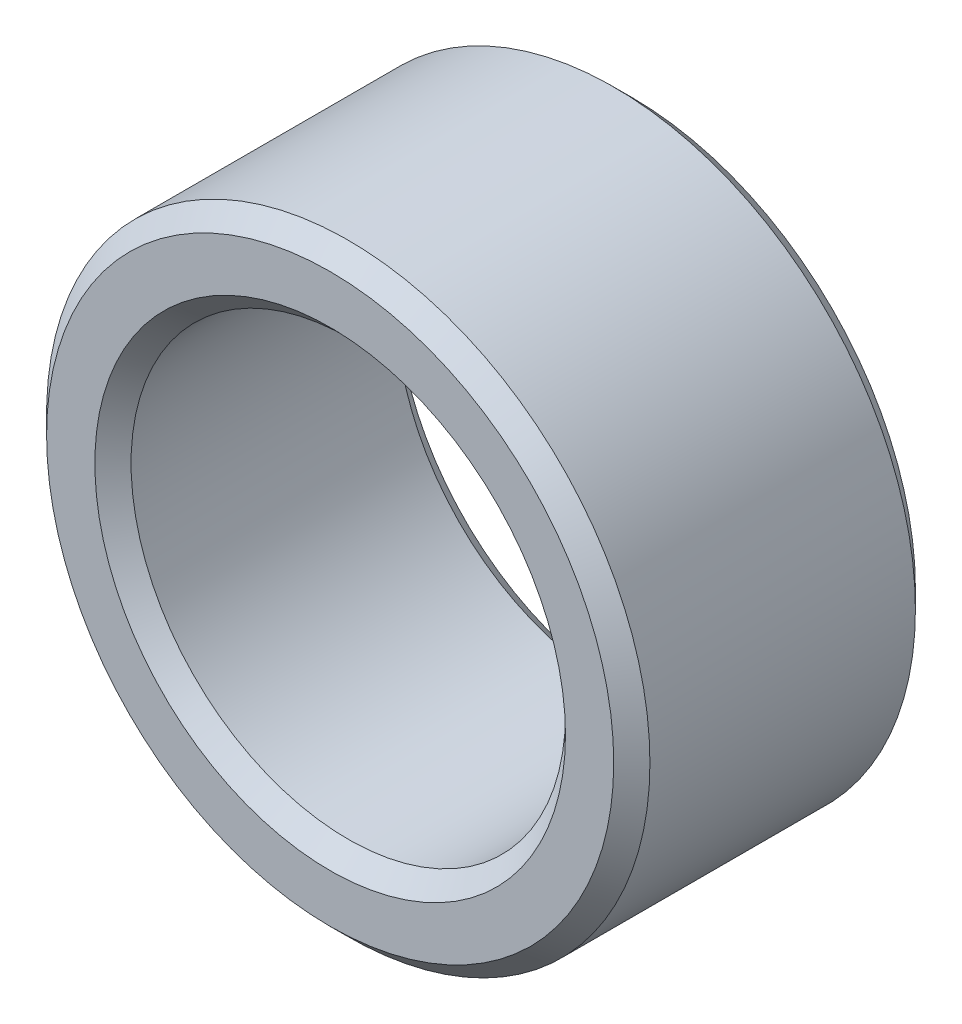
from build123d import *

# Parameters (mm, degrees)
BOSS_EXTRUDE1_DEPTH      = 0.79375
BOSS_EXTRUDE1_DEPTH_BACK = 0.79375
SKETCH3_R                = 1.5875
SKETCH3_R_2              = 1.143
CHAMFER1_SIZE            = 0.09525


with BuildPart() as part:
    # Sketch3 → Boss-Extrude1 (new, two sides: drawn at the far end of the back side and taken through both)
    with BuildSketch(Plane.XY.offset(-BOSS_EXTRUDE1_DEPTH_BACK)):
        Circle(SKETCH3_R)
        Circle(SKETCH3_R_2, mode=Mode.SUBTRACT)
    extrude(amount=BOSS_EXTRUDE1_DEPTH + BOSS_EXTRUDE1_DEPTH_BACK)

    # Chamfer1
    chamfer1_edges = [part.edges().sort_by_distance(p)[0] for p in [
        (-1.5875, 0, -0.79375),
        (-1.143, 0, -0.79375),
        (-1.5875, 0, 0.79375),
        (-1.143, 0, 0.79375),
    ]]
    chamfer(chamfer1_edges, length=CHAMFER1_SIZE)


solid = part.part
